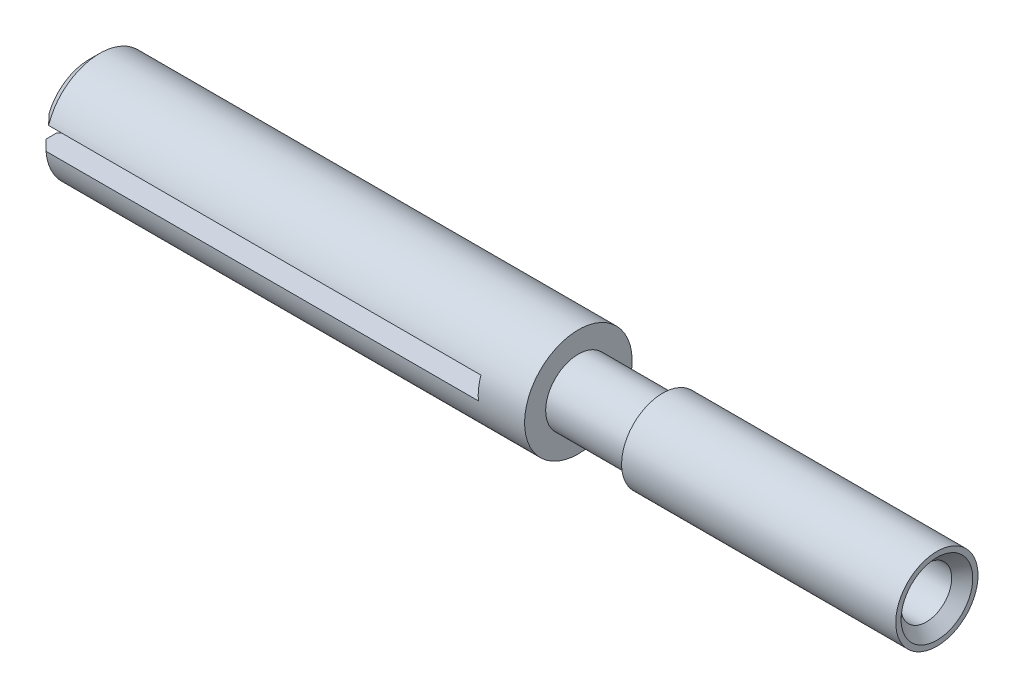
from build123d import *

# Parameters (mm, degrees)
ESQUISSE2_W             = 6
ESQUISSE2_H             = 1
ENL_V_MAT_EXTRU_1_DEPTH = 21


with BuildPart() as part:
    # Esquisse1 → Base-R_volution (revolve)
    with BuildSketch(Plane.XY, mode=Mode.PRIVATE) as base_r_volution_sk:
        Polygon((-28.7, 1.75), (-28.7, 1.25), (-28.2, 0.75), (-6.7, 0.75), (-6.2, 0), (-0.5, 0), (0, 0.9), (11, 0.9), (11.5, 1.4), (11.5, 1.65), (-0.6, 1.65), (-1.5, 1.65), (-1.5, 1.25), (-5.5, 1.25), (-5.5, 2.25), (-28.2, 2.25), align=None)
    revolve(base_r_volution_sk.sketch.rotate(Axis((-57.7, -0.3, 0), (1, 0, 0)), 180), axis=Axis((-57.7, -0.3, 0), (1, 0, 0)))

    # Esquisse2 → Enl_v. mat.-Extru.1 (cut)
    with BuildSketch(Plane.ZY.offset(28.7)):
        Rectangle(ESQUISSE2_W, ESQUISSE2_H)
    extrude(amount=-ENL_V_MAT_EXTRU_1_DEPTH, mode=Mode.SUBTRACT)


solid = part.part
